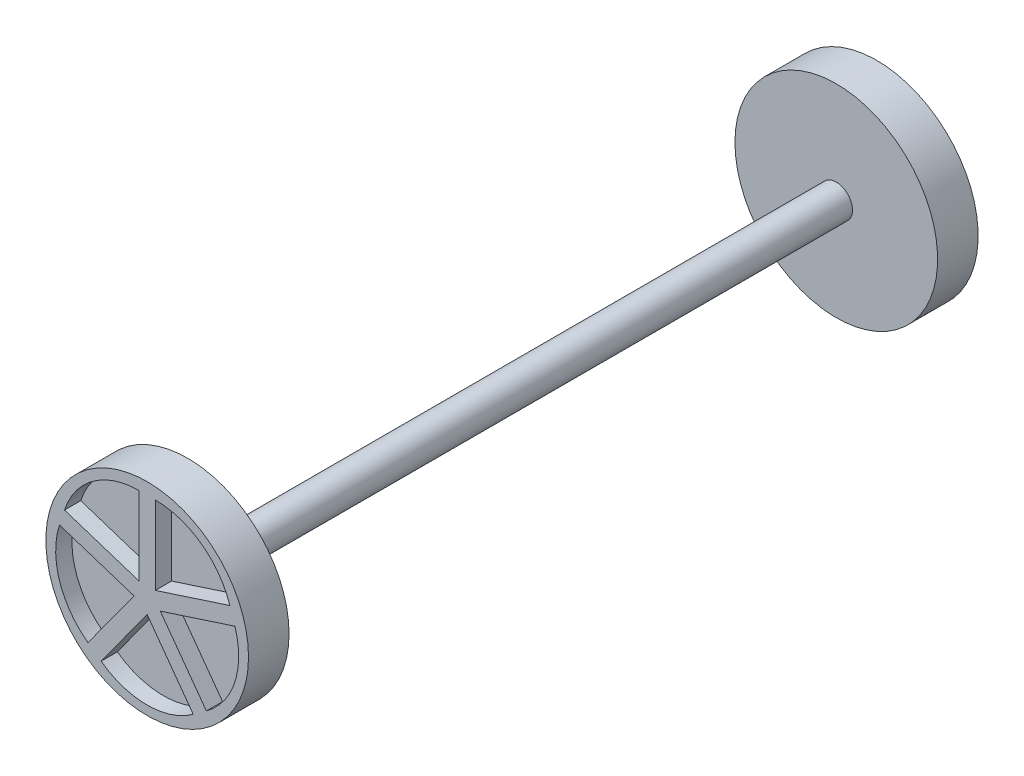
ISO-10303-21;
HEADER;
FILE_DESCRIPTION(('STEP AP214'),'2;1');
FILE_NAME('part.step','',(''),(''),'','','');
FILE_SCHEMA(('AUTOMOTIVE_DESIGN { 1 0 10303 214 1 1 1 1 }'));
ENDSEC;
DATA;
#1=APPLICATION_CONTEXT('core data for automotive mechanical design processes');
#2=APPLICATION_PROTOCOL_DEFINITION('international standard','automotive_design',2000,#1);
#3=PRODUCT_CONTEXT('',#1,'mechanical');
#4=PRODUCT('Part','Part','',(#3));
#5=PRODUCT_RELATED_PRODUCT_CATEGORY('part','',(#4));
#6=PRODUCT_DEFINITION_FORMATION('','',#4);
#7=PRODUCT_DEFINITION_CONTEXT('part definition',#1,'design');
#8=PRODUCT_DEFINITION('design','',#6,#7);
#9=PRODUCT_DEFINITION_SHAPE('','',#8);
#10=(LENGTH_UNIT() NAMED_UNIT(*) SI_UNIT(.MILLI.,.METRE.));
#11=(NAMED_UNIT(*) PLANE_ANGLE_UNIT() SI_UNIT($,.RADIAN.));
#12=(NAMED_UNIT(*) SI_UNIT($,.STERADIAN.) SOLID_ANGLE_UNIT());
#13=UNCERTAINTY_MEASURE_WITH_UNIT(LENGTH_MEASURE(1.E-05),#10,'distance_accuracy_value','');
#14=(GEOMETRIC_REPRESENTATION_CONTEXT(3) GLOBAL_UNCERTAINTY_ASSIGNED_CONTEXT((#13)) GLOBAL_UNIT_ASSIGNED_CONTEXT((#10,
#11,#12)) REPRESENTATION_CONTEXT('',''));
#15=CARTESIAN_POINT('',(0.,0.,0.));
#16=DIRECTION('',(0.,0.,1.));
#17=DIRECTION('',(1.,0.,0.));
#18=AXIS2_PLACEMENT_3D('',#15,#16,#17);
#19=CARTESIAN_POINT('',(0.,0.,-45.));
#20=DIRECTION('',(0.,0.,-1.));
#21=DIRECTION('',(-1.,0.,0.));
#22=AXIS2_PLACEMENT_3D('',#19,#20,#21);
#23=PLANE('',#22);
#24=CARTESIAN_POINT('',(-1.6180339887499,-0.525731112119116,-45.));
#25=DIRECTION('',(0.,0.,1.));
#26=DIRECTION('',(0.809016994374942,-0.58778525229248,0.));
#27=AXIS2_PLACEMENT_3D('',#24,#25,#26);
#28=CIRCLE('',#27,9.67108615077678);
#29=CARTESIAN_POINT('',(-10.8157834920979,2.46279886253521,-45.));
#30=VERTEX_POINT('',#29);
#31=CARTESIAN_POINT('',(-7.30255580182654,-8.34980416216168,-45.));
#32=VERTEX_POINT('',#31);
#33=EDGE_CURVE('E275',#30,#32,#28,.T.);
#34=ORIENTED_EDGE('',*,*,#33,.T.);
#35=DIRECTION('',(0.58778525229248,0.809016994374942,0.));
#36=VECTOR('',#35,1.);
#37=CARTESIAN_POINT('',(-1.6180339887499,-0.525731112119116,-45.));
#38=LINE('',#37,#36);
#39=CARTESIAN_POINT('',(-1.6180339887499,-0.525731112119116,-45.));
#40=VERTEX_POINT('',#39);
#41=EDGE_CURVE('E59',#32,#40,#38,.T.);
#42=ORIENTED_EDGE('',*,*,#41,.T.);
#43=DIRECTION('',(-0.95105651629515,0.309016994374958,0.));
#44=VECTOR('',#43,1.);
#45=CARTESIAN_POINT('',(-1.6180339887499,-0.525731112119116,-45.));
#46=LINE('',#45,#44);
#47=EDGE_CURVE('E269',#40,#30,#46,.T.);
#48=ORIENTED_EDGE('',*,*,#47,.T.);
#49=EDGE_LOOP('',(#34,#42,#48));
#50=FACE_BOUND('',#49,.T.);
#51=CARTESIAN_POINT('',(1.61803398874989,-0.525731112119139,-45.));
#52=DIRECTION('',(0.,0.,1.));
#53=DIRECTION('',(-0.309016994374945,0.951056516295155,0.));
#54=AXIS2_PLACEMENT_3D('',#51,#52,#53);
#55=CIRCLE('',#54,9.67108615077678);
#56=CARTESIAN_POINT('',(7.30255580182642,-8.34980416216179,-45.));
#57=VERTEX_POINT('',#56);
#58=CARTESIAN_POINT('',(10.815783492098,2.46279886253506,-45.));
#59=VERTEX_POINT('',#58);
#60=EDGE_CURVE('E321',#57,#59,#55,.T.);
#61=ORIENTED_EDGE('',*,*,#60,.T.);
#62=DIRECTION('',(-0.951056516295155,-0.309016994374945,0.));
#63=VECTOR('',#62,1.);
#64=CARTESIAN_POINT('',(1.61803398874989,-0.525731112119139,-45.));
#65=LINE('',#64,#63);
#66=CARTESIAN_POINT('',(1.61803398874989,-0.525731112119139,-45.));
#67=VERTEX_POINT('',#66);
#68=EDGE_CURVE('E305',#59,#67,#65,.T.);
#69=ORIENTED_EDGE('',*,*,#68,.T.);
#70=DIRECTION('',(0.587785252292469,-0.809016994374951,0.));
#71=VECTOR('',#70,1.);
#72=CARTESIAN_POINT('',(1.61803398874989,-0.525731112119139,-45.));
#73=LINE('',#72,#71);
#74=EDGE_CURVE('E314',#67,#57,#73,.T.);
#75=ORIENTED_EDGE('',*,*,#74,.T.);
#76=EDGE_LOOP('',(#61,#69,#75));
#77=FACE_BOUND('',#76,.T.);
#78=CARTESIAN_POINT('',(0.,0.,-45.));
#79=DIRECTION('',(0.,0.,-1.));
#80=DIRECTION('',(-1.,0.,0.));
#81=AXIS2_PLACEMENT_3D('',#78,#79,#80);
#82=CIRCLE('',#81,12.5);
#83=CARTESIAN_POINT('',(-12.5,0.,-45.));
#84=VERTEX_POINT('',#83);
#85=EDGE_CURVE('E478',#84,#84,#82,.T.);
#86=ORIENTED_EDGE('',*,*,#85,.T.);
#87=EDGE_LOOP('',(#86));
#88=FACE_BOUND('',#87,.T.);
#89=CARTESIAN_POINT('',(1.,1.37638192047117,-45.));
#90=DIRECTION('',(0.,0.,1.));
#91=DIRECTION('',(-1.,0.,0.));
#92=AXIS2_PLACEMENT_3D('',#89,#90,#91);
#93=CIRCLE('',#92,9.67108615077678);
#94=CARTESIAN_POINT('',(10.1977495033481,4.36491189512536,-45.));
#95=VERTEX_POINT('',#94);
#96=CARTESIAN_POINT('',(0.999999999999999,11.047468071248,-45.));
#97=VERTEX_POINT('',#96);
#98=EDGE_CURVE('E345',#95,#97,#93,.T.);
#99=ORIENTED_EDGE('',*,*,#98,.T.);
#100=DIRECTION('',(0.,-1.,0.));
#101=VECTOR('',#100,1.);
#102=CARTESIAN_POINT('',(1.,1.37638192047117,-45.));
#103=LINE('',#102,#101);
#104=CARTESIAN_POINT('',(1.,1.37638192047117,-45.));
#105=VERTEX_POINT('',#104);
#106=EDGE_CURVE('E329',#97,#105,#103,.T.);
#107=ORIENTED_EDGE('',*,*,#106,.T.);
#108=DIRECTION('',(0.951056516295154,0.309016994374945,0.));
#109=VECTOR('',#108,1.);
#110=CARTESIAN_POINT('',(1.,1.37638192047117,-45.));
#111=LINE('',#110,#109);
#112=EDGE_CURVE('E338',#105,#95,#111,.T.);
#113=ORIENTED_EDGE('',*,*,#112,.T.);
#114=EDGE_LOOP('',(#99,#107,#113));
#115=FACE_BOUND('',#114,.T.);
#116=CARTESIAN_POINT('',(0.,-1.70130161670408,-45.));
#117=DIRECTION('',(0.,0.,1.));
#118=DIRECTION('',(0.809016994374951,0.587785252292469,0.));
#119=AXIS2_PLACEMENT_3D('',#116,#117,#118);
#120=CIRCLE('',#119,9.67108615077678);
#121=CARTESIAN_POINT('',(-5.68452181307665,-9.52537466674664,-45.));
#122=VERTEX_POINT('',#121);
#123=CARTESIAN_POINT('',(5.68452181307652,-9.52537466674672,-45.));
#124=VERTEX_POINT('',#123);
#125=EDGE_CURVE('E297',#122,#124,#120,.T.);
#126=ORIENTED_EDGE('',*,*,#125,.T.);
#127=DIRECTION('',(-0.587785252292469,0.809016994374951,0.));
#128=VECTOR('',#127,1.);
#129=CARTESIAN_POINT('',(0.,-1.70130161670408,-45.));
#130=LINE('',#129,#128);
#131=CARTESIAN_POINT('',(0.,-1.70130161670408,-45.));
#132=VERTEX_POINT('',#131);
#133=EDGE_CURVE('E282',#124,#132,#130,.T.);
#134=ORIENTED_EDGE('',*,*,#133,.T.);
#135=DIRECTION('',(-0.58778525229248,-0.809016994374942,0.));
#136=VECTOR('',#135,1.);
#137=CARTESIAN_POINT('',(0.,-1.70130161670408,-45.));
#138=LINE('',#137,#136);
#139=EDGE_CURVE('E290',#132,#122,#138,.T.);
#140=ORIENTED_EDGE('',*,*,#139,.T.);
#141=EDGE_LOOP('',(#126,#134,#140));
#142=FACE_BOUND('',#141,.T.);
#143=CARTESIAN_POINT('',(-0.999999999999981,1.37638192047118,-45.));
#144=DIRECTION('',(0.,0.,1.));
#145=DIRECTION('',(-0.309016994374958,-0.95105651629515,0.));
#146=AXIS2_PLACEMENT_3D('',#143,#144,#145);
#147=CIRCLE('',#146,9.67108615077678);
#148=CARTESIAN_POINT('',(-0.999999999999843,11.047468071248,-45.));
#149=VERTEX_POINT('',#148);
#150=CARTESIAN_POINT('',(-10.197749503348,4.36491189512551,-45.));
#151=VERTEX_POINT('',#150);
#152=EDGE_CURVE('E256',#149,#151,#147,.T.);
#153=ORIENTED_EDGE('',*,*,#152,.T.);
#154=DIRECTION('',(0.95105651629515,-0.309016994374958,0.));
#155=VECTOR('',#154,1.);
#156=CARTESIAN_POINT('',(-0.999999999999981,1.37638192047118,-45.));
#157=LINE('',#156,#155);
#158=CARTESIAN_POINT('',(-0.999999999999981,1.37638192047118,-45.));
#159=VERTEX_POINT('',#158);
#160=EDGE_CURVE('E51',#151,#159,#157,.T.);
#161=ORIENTED_EDGE('',*,*,#160,.T.);
#162=DIRECTION('',(0.,1.,0.));
#163=VECTOR('',#162,1.);
#164=CARTESIAN_POINT('',(-0.999999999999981,1.37638192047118,-45.));
#165=LINE('',#164,#163);
#166=EDGE_CURVE('E253',#159,#149,#165,.T.);
#167=ORIENTED_EDGE('',*,*,#166,.T.);
#168=EDGE_LOOP('',(#153,#161,#167));
#169=FACE_BOUND('',#168,.T.);
#170=ADVANCED_FACE('F36',(#50,#77,#88,#115,#142,#169),#23,.T.);
#171=CARTESIAN_POINT('',(0.,0.,40.));
#172=DIRECTION('',(0.,0.,-1.));
#173=DIRECTION('',(-1.,0.,0.));
#174=AXIS2_PLACEMENT_3D('',#171,#172,#173);
#175=CYLINDRICAL_SURFACE('',#174,2.);
#176=CARTESIAN_POINT('',(0.,0.,40.));
#177=DIRECTION('',(0.,0.,1.));
#178=DIRECTION('',(1.,0.,0.));
#179=AXIS2_PLACEMENT_3D('',#176,#177,#178);
#180=CIRCLE('',#179,2.);
#181=CARTESIAN_POINT('',(2.,0.,40.));
#182=VERTEX_POINT('',#181);
#183=EDGE_CURVE('E11',#182,#182,#180,.T.);
#184=ORIENTED_EDGE('',*,*,#183,.F.);
#185=EDGE_LOOP('',(#184));
#186=FACE_BOUND('',#185,.T.);
#187=CARTESIAN_POINT('',(0.,0.,-40.));
#188=DIRECTION('',(0.,0.,-1.));
#189=DIRECTION('',(-1.,0.,0.));
#190=AXIS2_PLACEMENT_3D('',#187,#188,#189);
#191=CIRCLE('',#190,2.);
#192=CARTESIAN_POINT('',(-2.,0.,-40.));
#193=VERTEX_POINT('',#192);
#194=EDGE_CURVE('E481',#193,#193,#191,.T.);
#195=ORIENTED_EDGE('',*,*,#194,.F.);
#196=EDGE_LOOP('',(#195));
#197=FACE_BOUND('',#196,.T.);
#198=ADVANCED_FACE('F38',(#186,#197),#175,.T.);
#199=CARTESIAN_POINT('',(0.,0.,40.));
#200=DIRECTION('',(0.,0.,1.));
#201=DIRECTION('',(1.,0.,0.));
#202=AXIS2_PLACEMENT_3D('',#199,#200,#201);
#203=PLANE('',#202);
#204=CARTESIAN_POINT('',(0.,0.,40.));
#205=DIRECTION('',(0.,0.,1.));
#206=DIRECTION('',(1.,0.,0.));
#207=AXIS2_PLACEMENT_3D('',#204,#205,#206);
#208=CIRCLE('',#207,12.5);
#209=CARTESIAN_POINT('',(12.5,0.,40.));
#210=VERTEX_POINT('',#209);
#211=EDGE_CURVE('E486',#210,#210,#208,.T.);
#212=ORIENTED_EDGE('',*,*,#211,.F.);
#213=EDGE_LOOP('',(#212));
#214=FACE_BOUND('',#213,.T.);
#215=ORIENTED_EDGE('',*,*,#183,.T.);
#216=EDGE_LOOP('',(#215));
#217=FACE_BOUND('',#216,.T.);
#218=ADVANCED_FACE('F493',(#214,#217),#203,.F.);
#219=CARTESIAN_POINT('',(0.,0.,45.));
#220=DIRECTION('',(0.,0.,-1.));
#221=DIRECTION('',(-1.,0.,0.));
#222=AXIS2_PLACEMENT_3D('',#219,#220,#221);
#223=CYLINDRICAL_SURFACE('',#222,12.5);
#224=CARTESIAN_POINT('',(0.,0.,45.));
#225=DIRECTION('',(0.,0.,1.));
#226=DIRECTION('',(1.,0.,0.));
#227=AXIS2_PLACEMENT_3D('',#224,#225,#226);
#228=CIRCLE('',#227,12.5);
#229=CARTESIAN_POINT('',(12.5,0.,45.));
#230=VERTEX_POINT('',#229);
#231=EDGE_CURVE('E44',#230,#230,#228,.T.);
#232=ORIENTED_EDGE('',*,*,#231,.F.);
#233=EDGE_LOOP('',(#232));
#234=FACE_BOUND('',#233,.T.);
#235=ORIENTED_EDGE('',*,*,#211,.T.);
#236=EDGE_LOOP('',(#235));
#237=FACE_BOUND('',#236,.T.);
#238=ADVANCED_FACE('F491',(#234,#237),#223,.T.);
#239=CARTESIAN_POINT('',(0.,0.,45.));
#240=DIRECTION('',(0.,0.,1.));
#241=DIRECTION('',(1.,0.,0.));
#242=AXIS2_PLACEMENT_3D('',#239,#240,#241);
#243=PLANE('',#242);
#244=DIRECTION('',(0.95105651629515,-0.309016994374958,0.));
#245=VECTOR('',#244,1.);
#246=CARTESIAN_POINT('',(-0.999999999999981,1.37638192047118,45.));
#247=LINE('',#246,#245);
#248=CARTESIAN_POINT('',(-10.197749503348,4.36491189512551,45.));
#249=VERTEX_POINT('',#248);
#250=CARTESIAN_POINT('',(-0.999999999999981,1.37638192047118,45.));
#251=VERTEX_POINT('',#250);
#252=EDGE_CURVE('E353',#249,#251,#247,.T.);
#253=ORIENTED_EDGE('',*,*,#252,.F.);
#254=CARTESIAN_POINT('',(-0.999999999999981,1.37638192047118,45.));
#255=DIRECTION('',(0.,0.,1.));
#256=DIRECTION('',(-0.309016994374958,-0.95105651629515,0.));
#257=AXIS2_PLACEMENT_3D('',#254,#255,#256);
#258=CIRCLE('',#257,9.67108615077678);
#259=CARTESIAN_POINT('',(-0.999999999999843,11.047468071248,45.));
#260=VERTEX_POINT('',#259);
#261=EDGE_CURVE('E362',#260,#249,#258,.T.);
#262=ORIENTED_EDGE('',*,*,#261,.F.);
#263=DIRECTION('',(0.,1.,0.));
#264=VECTOR('',#263,1.);
#265=CARTESIAN_POINT('',(-0.999999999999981,1.37638192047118,45.));
#266=LINE('',#265,#264);
#267=EDGE_CURVE('E370',#251,#260,#266,.T.);
#268=ORIENTED_EDGE('',*,*,#267,.F.);
#269=EDGE_LOOP('',(#253,#262,#268));
#270=FACE_BOUND('',#269,.T.);
#271=DIRECTION('',(0.58778525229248,0.809016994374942,0.));
#272=VECTOR('',#271,1.);
#273=CARTESIAN_POINT('',(-1.6180339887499,-0.525731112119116,45.));
#274=LINE('',#273,#272);
#275=CARTESIAN_POINT('',(-7.30255580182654,-8.34980416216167,45.));
#276=VERTEX_POINT('',#275);
#277=CARTESIAN_POINT('',(-1.6180339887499,-0.525731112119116,45.));
#278=VERTEX_POINT('',#277);
#279=EDGE_CURVE('E377',#276,#278,#274,.T.);
#280=ORIENTED_EDGE('',*,*,#279,.F.);
#281=CARTESIAN_POINT('',(-1.6180339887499,-0.525731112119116,45.));
#282=DIRECTION('',(0.,0.,1.));
#283=DIRECTION('',(0.809016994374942,-0.58778525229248,0.));
#284=AXIS2_PLACEMENT_3D('',#281,#282,#283);
#285=CIRCLE('',#284,9.67108615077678);
#286=CARTESIAN_POINT('',(-10.8157834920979,2.46279886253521,45.));
#287=VERTEX_POINT('',#286);
#288=EDGE_CURVE('E386',#287,#276,#285,.T.);
#289=ORIENTED_EDGE('',*,*,#288,.F.);
#290=DIRECTION('',(-0.95105651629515,0.309016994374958,0.));
#291=VECTOR('',#290,1.);
#292=CARTESIAN_POINT('',(-1.6180339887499,-0.525731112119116,45.));
#293=LINE('',#292,#291);
#294=EDGE_CURVE('E394',#278,#287,#293,.T.);
#295=ORIENTED_EDGE('',*,*,#294,.F.);
#296=EDGE_LOOP('',(#280,#289,#295));
#297=FACE_BOUND('',#296,.T.);
#298=DIRECTION('',(-0.587785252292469,0.809016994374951,0.));
#299=VECTOR('',#298,1.);
#300=CARTESIAN_POINT('',(0.,-1.70130161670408,45.));
#301=LINE('',#300,#299);
#302=CARTESIAN_POINT('',(5.68452181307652,-9.52537466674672,45.));
#303=VERTEX_POINT('',#302);
#304=CARTESIAN_POINT('',(0.,-1.70130161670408,45.));
#305=VERTEX_POINT('',#304);
#306=EDGE_CURVE('E401',#303,#305,#301,.T.);
#307=ORIENTED_EDGE('',*,*,#306,.F.);
#308=CARTESIAN_POINT('',(0.,-1.70130161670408,45.));
#309=DIRECTION('',(0.,0.,1.));
#310=DIRECTION('',(0.809016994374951,0.587785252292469,0.));
#311=AXIS2_PLACEMENT_3D('',#308,#309,#310);
#312=CIRCLE('',#311,9.67108615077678);
#313=CARTESIAN_POINT('',(-5.68452181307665,-9.52537466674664,45.));
#314=VERTEX_POINT('',#313);
#315=EDGE_CURVE('E410',#314,#303,#312,.T.);
#316=ORIENTED_EDGE('',*,*,#315,.F.);
#317=DIRECTION('',(-0.58778525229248,-0.809016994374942,0.));
#318=VECTOR('',#317,1.);
#319=CARTESIAN_POINT('',(0.,-1.70130161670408,45.));
#320=LINE('',#319,#318);
#321=EDGE_CURVE('E418',#305,#314,#320,.T.);
#322=ORIENTED_EDGE('',*,*,#321,.F.);
#323=EDGE_LOOP('',(#307,#316,#322));
#324=FACE_BOUND('',#323,.T.);
#325=DIRECTION('',(-0.951056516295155,-0.309016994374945,0.));
#326=VECTOR('',#325,1.);
#327=CARTESIAN_POINT('',(1.61803398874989,-0.525731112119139,45.));
#328=LINE('',#327,#326);
#329=CARTESIAN_POINT('',(10.815783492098,2.46279886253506,45.));
#330=VERTEX_POINT('',#329);
#331=CARTESIAN_POINT('',(1.61803398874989,-0.525731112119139,45.));
#332=VERTEX_POINT('',#331);
#333=EDGE_CURVE('E425',#330,#332,#328,.T.);
#334=ORIENTED_EDGE('',*,*,#333,.F.);
#335=CARTESIAN_POINT('',(1.61803398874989,-0.525731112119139,45.));
#336=DIRECTION('',(0.,0.,1.));
#337=DIRECTION('',(-0.309016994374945,0.951056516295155,0.));
#338=AXIS2_PLACEMENT_3D('',#335,#336,#337);
#339=CIRCLE('',#338,9.67108615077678);
#340=CARTESIAN_POINT('',(7.30255580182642,-8.34980416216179,45.));
#341=VERTEX_POINT('',#340);
#342=EDGE_CURVE('E434',#341,#330,#339,.T.);
#343=ORIENTED_EDGE('',*,*,#342,.F.);
#344=DIRECTION('',(0.587785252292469,-0.809016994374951,0.));
#345=VECTOR('',#344,1.);
#346=CARTESIAN_POINT('',(1.61803398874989,-0.525731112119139,45.));
#347=LINE('',#346,#345);
#348=EDGE_CURVE('E442',#332,#341,#347,.T.);
#349=ORIENTED_EDGE('',*,*,#348,.F.);
#350=EDGE_LOOP('',(#334,#343,#349));
#351=FACE_BOUND('',#350,.T.);
#352=DIRECTION('',(0.,-1.,0.));
#353=VECTOR('',#352,1.);
#354=CARTESIAN_POINT('',(1.,1.37638192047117,45.));
#355=LINE('',#354,#353);
#356=CARTESIAN_POINT('',(0.999999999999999,11.047468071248,45.));
#357=VERTEX_POINT('',#356);
#358=CARTESIAN_POINT('',(1.,1.37638192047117,45.));
#359=VERTEX_POINT('',#358);
#360=EDGE_CURVE('E449',#357,#359,#355,.T.);
#361=ORIENTED_EDGE('',*,*,#360,.F.);
#362=CARTESIAN_POINT('',(1.,1.37638192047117,45.));
#363=DIRECTION('',(0.,0.,1.));
#364=DIRECTION('',(-1.,0.,0.));
#365=AXIS2_PLACEMENT_3D('',#362,#363,#364);
#366=CIRCLE('',#365,9.67108615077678);
#367=CARTESIAN_POINT('',(10.1977495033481,4.36491189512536,45.));
#368=VERTEX_POINT('',#367);
#369=EDGE_CURVE('E458',#368,#357,#366,.T.);
#370=ORIENTED_EDGE('',*,*,#369,.F.);
#371=DIRECTION('',(0.951056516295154,0.309016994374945,0.));
#372=VECTOR('',#371,1.);
#373=CARTESIAN_POINT('',(1.,1.37638192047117,45.));
#374=LINE('',#373,#372);
#375=EDGE_CURVE('E466',#359,#368,#374,.T.);
#376=ORIENTED_EDGE('',*,*,#375,.F.);
#377=EDGE_LOOP('',(#361,#370,#376));
#378=FACE_BOUND('',#377,.T.);
#379=ORIENTED_EDGE('',*,*,#231,.T.);
#380=EDGE_LOOP('',(#379));
#381=FACE_BOUND('',#380,.T.);
#382=ADVANCED_FACE('F506',(#270,#297,#324,#351,#378,#381),#243,.T.);
#383=CARTESIAN_POINT('',(0.,0.,-40.));
#384=DIRECTION('',(0.,0.,-1.));
#385=DIRECTION('',(-1.,0.,0.));
#386=AXIS2_PLACEMENT_3D('',#383,#384,#385);
#387=PLANE('',#386);
#388=CARTESIAN_POINT('',(0.,0.,-40.));
#389=DIRECTION('',(0.,0.,-1.));
#390=DIRECTION('',(-1.,0.,0.));
#391=AXIS2_PLACEMENT_3D('',#388,#389,#390);
#392=CIRCLE('',#391,12.5);
#393=CARTESIAN_POINT('',(-12.5,0.,-40.));
#394=VERTEX_POINT('',#393);
#395=EDGE_CURVE('E473',#394,#394,#392,.T.);
#396=ORIENTED_EDGE('',*,*,#395,.F.);
#397=EDGE_LOOP('',(#396));
#398=FACE_BOUND('',#397,.T.);
#399=ORIENTED_EDGE('',*,*,#194,.T.);
#400=EDGE_LOOP('',(#399));
#401=FACE_BOUND('',#400,.T.);
#402=ADVANCED_FACE('F503',(#398,#401),#387,.F.);
#403=CARTESIAN_POINT('',(0.,0.,-45.));
#404=DIRECTION('',(0.,0.,1.));
#405=DIRECTION('',(1.,0.,0.));
#406=AXIS2_PLACEMENT_3D('',#403,#404,#405);
#407=CYLINDRICAL_SURFACE('',#406,12.5);
#408=ORIENTED_EDGE('',*,*,#85,.F.);
#409=EDGE_LOOP('',(#408));
#410=FACE_BOUND('',#409,.T.);
#411=ORIENTED_EDGE('',*,*,#395,.T.);
#412=EDGE_LOOP('',(#411));
#413=FACE_BOUND('',#412,.T.);
#414=ADVANCED_FACE('F505',(#410,#413),#407,.T.);
#415=CARTESIAN_POINT('',(1.,1.37638192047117,43.));
#416=DIRECTION('',(-1.,0.,0.));
#417=DIRECTION('',(0.,0.,1.));
#418=AXIS2_PLACEMENT_3D('',#415,#416,#417);
#419=PLANE('',#418);
#420=ORIENTED_EDGE('',*,*,#360,.T.);
#421=DIRECTION('',(0.,0.,1.));
#422=VECTOR('',#421,1.);
#423=CARTESIAN_POINT('',(1.,1.37638192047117,43.));
#424=LINE('',#423,#422);
#425=CARTESIAN_POINT('',(1.,1.37638192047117,43.));
#426=VERTEX_POINT('',#425);
#427=EDGE_CURVE('E464',#426,#359,#424,.T.);
#428=ORIENTED_EDGE('',*,*,#427,.F.);
#429=DIRECTION('',(0.,-1.,0.));
#430=VECTOR('',#429,1.);
#431=CARTESIAN_POINT('',(1.,1.37638192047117,43.));
#432=LINE('',#431,#430);
#433=CARTESIAN_POINT('',(0.999999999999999,11.047468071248,43.));
#434=VERTEX_POINT('',#433);
#435=EDGE_CURVE('E454',#434,#426,#432,.T.);
#436=ORIENTED_EDGE('',*,*,#435,.F.);
#437=DIRECTION('',(0.,0.,1.));
#438=VECTOR('',#437,1.);
#439=CARTESIAN_POINT('',(0.999999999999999,11.047468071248,43.));
#440=LINE('',#439,#438);
#441=EDGE_CURVE('E471',#434,#357,#440,.T.);
#442=ORIENTED_EDGE('',*,*,#441,.T.);
#443=EDGE_LOOP('',(#420,#428,#436,#442));
#444=FACE_BOUND('',#443,.T.);
#445=ADVANCED_FACE('F513',(#444),#419,.F.);
#446=CARTESIAN_POINT('',(1.,1.37638192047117,43.));
#447=DIRECTION('',(0.,0.,1.));
#448=DIRECTION('',(1.,0.,0.));
#449=AXIS2_PLACEMENT_3D('',#446,#447,#448);
#450=CYLINDRICAL_SURFACE('',#449,9.67108615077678);
#451=ORIENTED_EDGE('',*,*,#369,.T.);
#452=ORIENTED_EDGE('',*,*,#441,.F.);
#453=CARTESIAN_POINT('',(1.,1.37638192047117,43.));
#454=DIRECTION('',(0.,0.,1.));
#455=DIRECTION('',(-1.,0.,0.));
#456=AXIS2_PLACEMENT_3D('',#453,#454,#455);
#457=CIRCLE('',#456,9.67108615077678);
#458=CARTESIAN_POINT('',(10.1977495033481,4.36491189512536,43.));
#459=VERTEX_POINT('',#458);
#460=EDGE_CURVE('E461',#459,#434,#457,.T.);
#461=ORIENTED_EDGE('',*,*,#460,.F.);
#462=DIRECTION('',(0.,0.,1.));
#463=VECTOR('',#462,1.);
#464=CARTESIAN_POINT('',(10.1977495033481,4.36491189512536,43.));
#465=LINE('',#464,#463);
#466=EDGE_CURVE('E474',#459,#368,#465,.T.);
#467=ORIENTED_EDGE('',*,*,#466,.T.);
#468=EDGE_LOOP('',(#451,#452,#461,#467));
#469=FACE_BOUND('',#468,.T.);
#470=ADVANCED_FACE('F528',(#469),#450,.F.);
#471=CARTESIAN_POINT('',(1.,1.37638192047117,43.));
#472=DIRECTION('',(0.309016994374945,-0.951056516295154,0.));
#473=DIRECTION('',(0.951056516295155,0.309016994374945,0.));
#474=AXIS2_PLACEMENT_3D('',#471,#472,#473);
#475=PLANE('',#474);
#476=ORIENTED_EDGE('',*,*,#375,.T.);
#477=ORIENTED_EDGE('',*,*,#466,.F.);
#478=DIRECTION('',(0.951056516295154,0.309016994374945,0.));
#479=VECTOR('',#478,1.);
#480=CARTESIAN_POINT('',(1.,1.37638192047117,43.));
#481=LINE('',#480,#479);
#482=EDGE_CURVE('E457',#426,#459,#481,.T.);
#483=ORIENTED_EDGE('',*,*,#482,.F.);
#484=ORIENTED_EDGE('',*,*,#427,.T.);
#485=EDGE_LOOP('',(#476,#477,#483,#484));
#486=FACE_BOUND('',#485,.T.);
#487=ADVANCED_FACE('F530',(#486),#475,.F.);
#488=CARTESIAN_POINT('',(1.,1.37638192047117,43.));
#489=DIRECTION('',(0.,0.,-1.));
#490=DIRECTION('',(-1.,0.,0.));
#491=AXIS2_PLACEMENT_3D('',#488,#489,#490);
#492=PLANE('',#491);
#493=ORIENTED_EDGE('',*,*,#435,.T.);
#494=ORIENTED_EDGE('',*,*,#482,.T.);
#495=ORIENTED_EDGE('',*,*,#460,.T.);
#496=EDGE_LOOP('',(#493,#494,#495));
#497=FACE_BOUND('',#496,.T.);
#498=ADVANCED_FACE('F533',(#497),#492,.F.);
#499=CARTESIAN_POINT('',(1.61803398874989,-0.525731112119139,43.));
#500=DIRECTION('',(-0.309016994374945,0.951056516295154,0.));
#501=DIRECTION('',(-0.951056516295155,-0.309016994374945,0.));
#502=AXIS2_PLACEMENT_3D('',#499,#500,#501);
#503=PLANE('',#502);
#504=ORIENTED_EDGE('',*,*,#333,.T.);
#505=DIRECTION('',(0.,0.,1.));
#506=VECTOR('',#505,1.);
#507=CARTESIAN_POINT('',(1.61803398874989,-0.525731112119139,43.));
#508=LINE('',#507,#506);
#509=CARTESIAN_POINT('',(1.61803398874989,-0.525731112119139,43.));
#510=VERTEX_POINT('',#509);
#511=EDGE_CURVE('E440',#510,#332,#508,.T.);
#512=ORIENTED_EDGE('',*,*,#511,.F.);
#513=DIRECTION('',(-0.951056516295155,-0.309016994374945,0.));
#514=VECTOR('',#513,1.);
#515=CARTESIAN_POINT('',(1.61803398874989,-0.525731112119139,43.));
#516=LINE('',#515,#514);
#517=CARTESIAN_POINT('',(10.815783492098,2.46279886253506,43.));
#518=VERTEX_POINT('',#517);
#519=EDGE_CURVE('E430',#518,#510,#516,.T.);
#520=ORIENTED_EDGE('',*,*,#519,.F.);
#521=DIRECTION('',(0.,0.,1.));
#522=VECTOR('',#521,1.);
#523=CARTESIAN_POINT('',(10.815783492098,2.46279886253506,43.));
#524=LINE('',#523,#522);
#525=EDGE_CURVE('E447',#518,#330,#524,.T.);
#526=ORIENTED_EDGE('',*,*,#525,.T.);
#527=EDGE_LOOP('',(#504,#512,#520,#526));
#528=FACE_BOUND('',#527,.T.);
#529=ADVANCED_FACE('F540',(#528),#503,.F.);
#530=CARTESIAN_POINT('',(1.61803398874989,-0.525731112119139,43.));
#531=DIRECTION('',(0.,0.,1.));
#532=DIRECTION('',(1.,0.,0.));
#533=AXIS2_PLACEMENT_3D('',#530,#531,#532);
#534=CYLINDRICAL_SURFACE('',#533,9.67108615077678);
#535=ORIENTED_EDGE('',*,*,#342,.T.);
#536=ORIENTED_EDGE('',*,*,#525,.F.);
#537=CARTESIAN_POINT('',(1.61803398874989,-0.525731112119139,43.));
#538=DIRECTION('',(0.,0.,1.));
#539=DIRECTION('',(-0.309016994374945,0.951056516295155,0.));
#540=AXIS2_PLACEMENT_3D('',#537,#538,#539);
#541=CIRCLE('',#540,9.67108615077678);
#542=CARTESIAN_POINT('',(7.30255580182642,-8.34980416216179,43.));
#543=VERTEX_POINT('',#542);
#544=EDGE_CURVE('E437',#543,#518,#541,.T.);
#545=ORIENTED_EDGE('',*,*,#544,.F.);
#546=DIRECTION('',(0.,0.,1.));
#547=VECTOR('',#546,1.);
#548=CARTESIAN_POINT('',(7.30255580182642,-8.34980416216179,43.));
#549=LINE('',#548,#547);
#550=EDGE_CURVE('E450',#543,#341,#549,.T.);
#551=ORIENTED_EDGE('',*,*,#550,.T.);
#552=EDGE_LOOP('',(#535,#536,#545,#551));
#553=FACE_BOUND('',#552,.T.);
#554=ADVANCED_FACE('F544',(#553),#534,.F.);
#555=CARTESIAN_POINT('',(1.61803398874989,-0.525731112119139,43.));
#556=DIRECTION('',(-0.809016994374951,-0.587785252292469,0.));
#557=DIRECTION('',(0.587785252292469,-0.809016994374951,0.));
#558=AXIS2_PLACEMENT_3D('',#555,#556,#557);
#559=PLANE('',#558);
#560=ORIENTED_EDGE('',*,*,#348,.T.);
#561=ORIENTED_EDGE('',*,*,#550,.F.);
#562=DIRECTION('',(0.587785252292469,-0.809016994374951,0.));
#563=VECTOR('',#562,1.);
#564=CARTESIAN_POINT('',(1.61803398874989,-0.525731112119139,43.));
#565=LINE('',#564,#563);
#566=EDGE_CURVE('E433',#510,#543,#565,.T.);
#567=ORIENTED_EDGE('',*,*,#566,.F.);
#568=ORIENTED_EDGE('',*,*,#511,.T.);
#569=EDGE_LOOP('',(#560,#561,#567,#568));
#570=FACE_BOUND('',#569,.T.);
#571=ADVANCED_FACE('F546',(#570),#559,.F.);
#572=CARTESIAN_POINT('',(1.61803398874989,-0.525731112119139,43.));
#573=DIRECTION('',(0.,0.,-1.));
#574=DIRECTION('',(-0.309016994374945,0.951056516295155,0.));
#575=AXIS2_PLACEMENT_3D('',#572,#573,#574);
#576=PLANE('',#575);
#577=ORIENTED_EDGE('',*,*,#519,.T.);
#578=ORIENTED_EDGE('',*,*,#566,.T.);
#579=ORIENTED_EDGE('',*,*,#544,.T.);
#580=EDGE_LOOP('',(#577,#578,#579));
#581=FACE_BOUND('',#580,.T.);
#582=ADVANCED_FACE('F549',(#581),#576,.F.);
#583=CARTESIAN_POINT('',(0.,-1.70130161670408,43.));
#584=DIRECTION('',(0.809016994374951,0.587785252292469,0.));
#585=DIRECTION('',(-0.587785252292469,0.809016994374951,0.));
#586=AXIS2_PLACEMENT_3D('',#583,#584,#585);
#587=PLANE('',#586);
#588=ORIENTED_EDGE('',*,*,#306,.T.);
#589=DIRECTION('',(0.,0.,1.));
#590=VECTOR('',#589,1.);
#591=CARTESIAN_POINT('',(0.,-1.70130161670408,43.));
#592=LINE('',#591,#590);
#593=CARTESIAN_POINT('',(0.,-1.70130161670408,43.));
#594=VERTEX_POINT('',#593);
#595=EDGE_CURVE('E416',#594,#305,#592,.T.);
#596=ORIENTED_EDGE('',*,*,#595,.F.);
#597=DIRECTION('',(-0.587785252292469,0.809016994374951,0.));
#598=VECTOR('',#597,1.);
#599=CARTESIAN_POINT('',(0.,-1.70130161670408,43.));
#600=LINE('',#599,#598);
#601=CARTESIAN_POINT('',(5.68452181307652,-9.52537466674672,43.));
#602=VERTEX_POINT('',#601);
#603=EDGE_CURVE('E406',#602,#594,#600,.T.);
#604=ORIENTED_EDGE('',*,*,#603,.F.);
#605=DIRECTION('',(0.,0.,1.));
#606=VECTOR('',#605,1.);
#607=CARTESIAN_POINT('',(5.68452181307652,-9.52537466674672,43.));
#608=LINE('',#607,#606);
#609=EDGE_CURVE('E423',#602,#303,#608,.T.);
#610=ORIENTED_EDGE('',*,*,#609,.T.);
#611=EDGE_LOOP('',(#588,#596,#604,#610));
#612=FACE_BOUND('',#611,.T.);
#613=ADVANCED_FACE('F556',(#612),#587,.F.);
#614=CARTESIAN_POINT('',(0.,-1.70130161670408,43.));
#615=DIRECTION('',(0.,0.,1.));
#616=DIRECTION('',(1.,0.,0.));
#617=AXIS2_PLACEMENT_3D('',#614,#615,#616);
#618=CYLINDRICAL_SURFACE('',#617,9.67108615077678);
#619=ORIENTED_EDGE('',*,*,#315,.T.);
#620=ORIENTED_EDGE('',*,*,#609,.F.);
#621=CARTESIAN_POINT('',(0.,-1.70130161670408,43.));
#622=DIRECTION('',(0.,0.,1.));
#623=DIRECTION('',(0.809016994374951,0.587785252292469,0.));
#624=AXIS2_PLACEMENT_3D('',#621,#622,#623);
#625=CIRCLE('',#624,9.67108615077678);
#626=CARTESIAN_POINT('',(-5.68452181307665,-9.52537466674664,43.));
#627=VERTEX_POINT('',#626);
#628=EDGE_CURVE('E413',#627,#602,#625,.T.);
#629=ORIENTED_EDGE('',*,*,#628,.F.);
#630=DIRECTION('',(0.,0.,1.));
#631=VECTOR('',#630,1.);
#632=CARTESIAN_POINT('',(-5.68452181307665,-9.52537466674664,43.));
#633=LINE('',#632,#631);
#634=EDGE_CURVE('E426',#627,#314,#633,.T.);
#635=ORIENTED_EDGE('',*,*,#634,.T.);
#636=EDGE_LOOP('',(#619,#620,#629,#635));
#637=FACE_BOUND('',#636,.T.);
#638=ADVANCED_FACE('F560',(#637),#618,.F.);
#639=CARTESIAN_POINT('',(0.,-1.70130161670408,43.));
#640=DIRECTION('',(-0.809016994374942,0.58778525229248,0.));
#641=DIRECTION('',(-0.58778525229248,-0.809016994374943,0.));
#642=AXIS2_PLACEMENT_3D('',#639,#640,#641);
#643=PLANE('',#642);
#644=ORIENTED_EDGE('',*,*,#321,.T.);
#645=ORIENTED_EDGE('',*,*,#634,.F.);
#646=DIRECTION('',(-0.58778525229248,-0.809016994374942,0.));
#647=VECTOR('',#646,1.);
#648=CARTESIAN_POINT('',(0.,-1.70130161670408,43.));
#649=LINE('',#648,#647);
#650=EDGE_CURVE('E409',#594,#627,#649,.T.);
#651=ORIENTED_EDGE('',*,*,#650,.F.);
#652=ORIENTED_EDGE('',*,*,#595,.T.);
#653=EDGE_LOOP('',(#644,#645,#651,#652));
#654=FACE_BOUND('',#653,.T.);
#655=ADVANCED_FACE('F562',(#654),#643,.F.);
#656=CARTESIAN_POINT('',(0.,-1.70130161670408,43.));
#657=DIRECTION('',(0.,0.,-1.));
#658=DIRECTION('',(0.809016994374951,0.587785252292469,0.));
#659=AXIS2_PLACEMENT_3D('',#656,#657,#658);
#660=PLANE('',#659);
#661=ORIENTED_EDGE('',*,*,#603,.T.);
#662=ORIENTED_EDGE('',*,*,#650,.T.);
#663=ORIENTED_EDGE('',*,*,#628,.T.);
#664=EDGE_LOOP('',(#661,#662,#663));
#665=FACE_BOUND('',#664,.T.);
#666=ADVANCED_FACE('F565',(#665),#660,.F.);
#667=CARTESIAN_POINT('',(-1.6180339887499,-0.525731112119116,43.));
#668=DIRECTION('',(0.809016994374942,-0.58778525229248,0.));
#669=DIRECTION('',(0.58778525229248,0.809016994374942,0.));
#670=AXIS2_PLACEMENT_3D('',#667,#668,#669);
#671=PLANE('',#670);
#672=ORIENTED_EDGE('',*,*,#279,.T.);
#673=DIRECTION('',(0.,0.,1.));
#674=VECTOR('',#673,1.);
#675=CARTESIAN_POINT('',(-1.6180339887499,-0.525731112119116,43.));
#676=LINE('',#675,#674);
#677=CARTESIAN_POINT('',(-1.6180339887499,-0.525731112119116,43.));
#678=VERTEX_POINT('',#677);
#679=EDGE_CURVE('E392',#678,#278,#676,.T.);
#680=ORIENTED_EDGE('',*,*,#679,.F.);
#681=DIRECTION('',(0.58778525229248,0.809016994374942,0.));
#682=VECTOR('',#681,1.);
#683=CARTESIAN_POINT('',(-1.6180339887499,-0.525731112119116,43.));
#684=LINE('',#683,#682);
#685=CARTESIAN_POINT('',(-7.30255580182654,-8.34980416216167,43.));
#686=VERTEX_POINT('',#685);
#687=EDGE_CURVE('E382',#686,#678,#684,.T.);
#688=ORIENTED_EDGE('',*,*,#687,.F.);
#689=DIRECTION('',(0.,0.,1.));
#690=VECTOR('',#689,1.);
#691=CARTESIAN_POINT('',(-7.30255580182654,-8.34980416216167,43.));
#692=LINE('',#691,#690);
#693=EDGE_CURVE('E399',#686,#276,#692,.T.);
#694=ORIENTED_EDGE('',*,*,#693,.T.);
#695=EDGE_LOOP('',(#672,#680,#688,#694));
#696=FACE_BOUND('',#695,.T.);
#697=ADVANCED_FACE('F572',(#696),#671,.F.);
#698=CARTESIAN_POINT('',(-1.6180339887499,-0.525731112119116,43.));
#699=DIRECTION('',(0.,0.,1.));
#700=DIRECTION('',(1.,0.,0.));
#701=AXIS2_PLACEMENT_3D('',#698,#699,#700);
#702=CYLINDRICAL_SURFACE('',#701,9.67108615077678);
#703=ORIENTED_EDGE('',*,*,#288,.T.);
#704=ORIENTED_EDGE('',*,*,#693,.F.);
#705=CARTESIAN_POINT('',(-1.6180339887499,-0.525731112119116,43.));
#706=DIRECTION('',(0.,0.,1.));
#707=DIRECTION('',(0.809016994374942,-0.58778525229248,0.));
#708=AXIS2_PLACEMENT_3D('',#705,#706,#707);
#709=CIRCLE('',#708,9.67108615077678);
#710=CARTESIAN_POINT('',(-10.8157834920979,2.46279886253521,43.));
#711=VERTEX_POINT('',#710);
#712=EDGE_CURVE('E389',#711,#686,#709,.T.);
#713=ORIENTED_EDGE('',*,*,#712,.F.);
#714=DIRECTION('',(0.,0.,1.));
#715=VECTOR('',#714,1.);
#716=CARTESIAN_POINT('',(-10.8157834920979,2.46279886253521,43.));
#717=LINE('',#716,#715);
#718=EDGE_CURVE('E402',#711,#287,#717,.T.);
#719=ORIENTED_EDGE('',*,*,#718,.T.);
#720=EDGE_LOOP('',(#703,#704,#713,#719));
#721=FACE_BOUND('',#720,.T.);
#722=ADVANCED_FACE('F576',(#721),#702,.F.);
#723=CARTESIAN_POINT('',(-1.6180339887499,-0.525731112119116,43.));
#724=DIRECTION('',(0.309016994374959,0.95105651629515,0.));
#725=DIRECTION('',(-0.95105651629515,0.309016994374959,0.));
#726=AXIS2_PLACEMENT_3D('',#723,#724,#725);
#727=PLANE('',#726);
#728=ORIENTED_EDGE('',*,*,#294,.T.);
#729=ORIENTED_EDGE('',*,*,#718,.F.);
#730=DIRECTION('',(-0.95105651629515,0.309016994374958,0.));
#731=VECTOR('',#730,1.);
#732=CARTESIAN_POINT('',(-1.6180339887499,-0.525731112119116,43.));
#733=LINE('',#732,#731);
#734=EDGE_CURVE('E385',#678,#711,#733,.T.);
#735=ORIENTED_EDGE('',*,*,#734,.F.);
#736=ORIENTED_EDGE('',*,*,#679,.T.);
#737=EDGE_LOOP('',(#728,#729,#735,#736));
#738=FACE_BOUND('',#737,.T.);
#739=ADVANCED_FACE('F578',(#738),#727,.F.);
#740=CARTESIAN_POINT('',(-1.6180339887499,-0.525731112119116,43.));
#741=DIRECTION('',(0.,0.,-1.));
#742=DIRECTION('',(0.809016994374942,-0.58778525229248,0.));
#743=AXIS2_PLACEMENT_3D('',#740,#741,#742);
#744=PLANE('',#743);
#745=ORIENTED_EDGE('',*,*,#687,.T.);
#746=ORIENTED_EDGE('',*,*,#734,.T.);
#747=ORIENTED_EDGE('',*,*,#712,.T.);
#748=EDGE_LOOP('',(#745,#746,#747));
#749=FACE_BOUND('',#748,.T.);
#750=ADVANCED_FACE('F581',(#749),#744,.F.);
#751=CARTESIAN_POINT('',(-0.999999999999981,1.37638192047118,43.));
#752=DIRECTION('',(-0.309016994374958,-0.95105651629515,0.));
#753=DIRECTION('',(0.95105651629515,-0.309016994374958,0.));
#754=AXIS2_PLACEMENT_3D('',#751,#752,#753);
#755=PLANE('',#754);
#756=ORIENTED_EDGE('',*,*,#252,.T.);
#757=DIRECTION('',(0.,0.,1.));
#758=VECTOR('',#757,1.);
#759=CARTESIAN_POINT('',(-0.999999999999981,1.37638192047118,43.));
#760=LINE('',#759,#758);
#761=CARTESIAN_POINT('',(-0.999999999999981,1.37638192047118,43.));
#762=VERTEX_POINT('',#761);
#763=EDGE_CURVE('E368',#762,#251,#760,.T.);
#764=ORIENTED_EDGE('',*,*,#763,.F.);
#765=DIRECTION('',(0.95105651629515,-0.309016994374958,0.));
#766=VECTOR('',#765,1.);
#767=CARTESIAN_POINT('',(-0.999999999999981,1.37638192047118,43.));
#768=LINE('',#767,#766);
#769=CARTESIAN_POINT('',(-10.197749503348,4.36491189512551,43.));
#770=VERTEX_POINT('',#769);
#771=EDGE_CURVE('E358',#770,#762,#768,.T.);
#772=ORIENTED_EDGE('',*,*,#771,.F.);
#773=DIRECTION('',(0.,0.,1.));
#774=VECTOR('',#773,1.);
#775=CARTESIAN_POINT('',(-10.197749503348,4.36491189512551,43.));
#776=LINE('',#775,#774);
#777=EDGE_CURVE('E375',#770,#249,#776,.T.);
#778=ORIENTED_EDGE('',*,*,#777,.T.);
#779=EDGE_LOOP('',(#756,#764,#772,#778));
#780=FACE_BOUND('',#779,.T.);
#781=ADVANCED_FACE('F588',(#780),#755,.F.);
#782=CARTESIAN_POINT('',(-0.999999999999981,1.37638192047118,43.));
#783=DIRECTION('',(0.,0.,1.));
#784=DIRECTION('',(1.,0.,0.));
#785=AXIS2_PLACEMENT_3D('',#782,#783,#784);
#786=CYLINDRICAL_SURFACE('',#785,9.67108615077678);
#787=ORIENTED_EDGE('',*,*,#261,.T.);
#788=ORIENTED_EDGE('',*,*,#777,.F.);
#789=CARTESIAN_POINT('',(-0.999999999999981,1.37638192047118,43.));
#790=DIRECTION('',(0.,0.,1.));
#791=DIRECTION('',(-0.309016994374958,-0.95105651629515,0.));
#792=AXIS2_PLACEMENT_3D('',#789,#790,#791);
#793=CIRCLE('',#792,9.67108615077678);
#794=CARTESIAN_POINT('',(-0.999999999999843,11.047468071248,43.));
#795=VERTEX_POINT('',#794);
#796=EDGE_CURVE('E365',#795,#770,#793,.T.);
#797=ORIENTED_EDGE('',*,*,#796,.F.);
#798=DIRECTION('',(0.,0.,1.));
#799=VECTOR('',#798,1.);
#800=CARTESIAN_POINT('',(-0.999999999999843,11.047468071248,43.));
#801=LINE('',#800,#799);
#802=EDGE_CURVE('E378',#795,#260,#801,.T.);
#803=ORIENTED_EDGE('',*,*,#802,.T.);
#804=EDGE_LOOP('',(#787,#788,#797,#803));
#805=FACE_BOUND('',#804,.T.);
#806=ADVANCED_FACE('F592',(#805),#786,.F.);
#807=CARTESIAN_POINT('',(-0.999999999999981,1.37638192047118,43.));
#808=DIRECTION('',(1.,0.,0.));
#809=DIRECTION('',(0.,1.,0.));
#810=AXIS2_PLACEMENT_3D('',#807,#808,#809);
#811=PLANE('',#810);
#812=ORIENTED_EDGE('',*,*,#267,.T.);
#813=ORIENTED_EDGE('',*,*,#802,.F.);
#814=DIRECTION('',(0.,1.,0.));
#815=VECTOR('',#814,1.);
#816=CARTESIAN_POINT('',(-0.999999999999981,1.37638192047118,43.));
#817=LINE('',#816,#815);
#818=EDGE_CURVE('E361',#762,#795,#817,.T.);
#819=ORIENTED_EDGE('',*,*,#818,.F.);
#820=ORIENTED_EDGE('',*,*,#763,.T.);
#821=EDGE_LOOP('',(#812,#813,#819,#820));
#822=FACE_BOUND('',#821,.T.);
#823=ADVANCED_FACE('F594',(#822),#811,.F.);
#824=CARTESIAN_POINT('',(-0.999999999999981,1.37638192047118,43.));
#825=DIRECTION('',(0.,0.,-1.));
#826=DIRECTION('',(-0.309016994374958,-0.95105651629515,0.));
#827=AXIS2_PLACEMENT_3D('',#824,#825,#826);
#828=PLANE('',#827);
#829=ORIENTED_EDGE('',*,*,#771,.T.);
#830=ORIENTED_EDGE('',*,*,#818,.T.);
#831=ORIENTED_EDGE('',*,*,#796,.T.);
#832=EDGE_LOOP('',(#829,#830,#831));
#833=FACE_BOUND('',#832,.T.);
#834=ADVANCED_FACE('F597',(#833),#828,.F.);
#835=CARTESIAN_POINT('',(1.,1.37638192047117,-43.));
#836=DIRECTION('',(1.,0.,0.));
#837=DIRECTION('',(0.,0.,-1.));
#838=AXIS2_PLACEMENT_3D('',#835,#836,#837);
#839=PLANE('',#838);
#840=ORIENTED_EDGE('',*,*,#106,.F.);
#841=DIRECTION('',(0.,0.,-1.));
#842=VECTOR('',#841,1.);
#843=CARTESIAN_POINT('',(0.999999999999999,11.047468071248,-43.));
#844=LINE('',#843,#842);
#845=CARTESIAN_POINT('',(0.999999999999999,11.047468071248,-43.));
#846=VERTEX_POINT('',#845);
#847=EDGE_CURVE('E342',#846,#97,#844,.T.);
#848=ORIENTED_EDGE('',*,*,#847,.F.);
#849=DIRECTION('',(0.,-1.,0.));
#850=VECTOR('',#849,1.);
#851=CARTESIAN_POINT('',(1.,1.37638192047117,-43.));
#852=LINE('',#851,#850);
#853=CARTESIAN_POINT('',(1.,1.37638192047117,-43.));
#854=VERTEX_POINT('',#853);
#855=EDGE_CURVE('E334',#846,#854,#852,.T.);
#856=ORIENTED_EDGE('',*,*,#855,.T.);
#857=DIRECTION('',(0.,0.,-1.));
#858=VECTOR('',#857,1.);
#859=CARTESIAN_POINT('',(1.,1.37638192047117,-43.));
#860=LINE('',#859,#858);
#861=EDGE_CURVE('E350',#854,#105,#860,.T.);
#862=ORIENTED_EDGE('',*,*,#861,.T.);
#863=EDGE_LOOP('',(#840,#848,#856,#862));
#864=FACE_BOUND('',#863,.T.);
#865=ADVANCED_FACE('F604',(#864),#839,.T.);
#866=CARTESIAN_POINT('',(1.,1.37638192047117,-43.));
#867=DIRECTION('',(-0.309016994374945,0.951056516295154,0.));
#868=DIRECTION('',(-0.951056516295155,-0.309016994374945,0.));
#869=AXIS2_PLACEMENT_3D('',#866,#867,#868);
#870=PLANE('',#869);
#871=ORIENTED_EDGE('',*,*,#112,.F.);
#872=ORIENTED_EDGE('',*,*,#861,.F.);
#873=DIRECTION('',(0.951056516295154,0.309016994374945,0.));
#874=VECTOR('',#873,1.);
#875=CARTESIAN_POINT('',(1.,1.37638192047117,-43.));
#876=LINE('',#875,#874);
#877=CARTESIAN_POINT('',(10.1977495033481,4.36491189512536,-43.));
#878=VERTEX_POINT('',#877);
#879=EDGE_CURVE('E340',#854,#878,#876,.T.);
#880=ORIENTED_EDGE('',*,*,#879,.T.);
#881=DIRECTION('',(0.,0.,-1.));
#882=VECTOR('',#881,1.);
#883=CARTESIAN_POINT('',(10.1977495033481,4.36491189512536,-43.));
#884=LINE('',#883,#882);
#885=EDGE_CURVE('E354',#878,#95,#884,.T.);
#886=ORIENTED_EDGE('',*,*,#885,.T.);
#887=EDGE_LOOP('',(#871,#872,#880,#886));
#888=FACE_BOUND('',#887,.T.);
#889=ADVANCED_FACE('F608',(#888),#870,.T.);
#890=CARTESIAN_POINT('',(1.,1.37638192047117,-43.));
#891=DIRECTION('',(0.,0.,-1.));
#892=DIRECTION('',(-1.,0.,0.));
#893=AXIS2_PLACEMENT_3D('',#890,#891,#892);
#894=CYLINDRICAL_SURFACE('',#893,9.67108615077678);
#895=ORIENTED_EDGE('',*,*,#98,.F.);
#896=ORIENTED_EDGE('',*,*,#885,.F.);
#897=CARTESIAN_POINT('',(1.,1.37638192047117,-43.));
#898=DIRECTION('',(0.,0.,1.));
#899=DIRECTION('',(-1.,0.,0.));
#900=AXIS2_PLACEMENT_3D('',#897,#898,#899);
#901=CIRCLE('',#900,9.67108615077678);
#902=EDGE_CURVE('E337',#878,#846,#901,.T.);
#903=ORIENTED_EDGE('',*,*,#902,.T.);
#904=ORIENTED_EDGE('',*,*,#847,.T.);
#905=EDGE_LOOP('',(#895,#896,#903,#904));
#906=FACE_BOUND('',#905,.T.);
#907=ADVANCED_FACE('F610',(#906),#894,.F.);
#908=CARTESIAN_POINT('',(1.,1.37638192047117,-43.));
#909=DIRECTION('',(0.,0.,1.));
#910=DIRECTION('',(-1.,0.,0.));
#911=AXIS2_PLACEMENT_3D('',#908,#909,#910);
#912=PLANE('',#911);
#913=ORIENTED_EDGE('',*,*,#855,.F.);
#914=ORIENTED_EDGE('',*,*,#902,.F.);
#915=ORIENTED_EDGE('',*,*,#879,.F.);
#916=EDGE_LOOP('',(#913,#914,#915));
#917=FACE_BOUND('',#916,.T.);
#918=ADVANCED_FACE('F613',(#917),#912,.F.);
#919=CARTESIAN_POINT('',(1.61803398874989,-0.525731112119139,-43.));
#920=DIRECTION('',(0.309016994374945,-0.951056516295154,0.));
#921=DIRECTION('',(0.951056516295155,0.309016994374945,0.));
#922=AXIS2_PLACEMENT_3D('',#919,#920,#921);
#923=PLANE('',#922);
#924=ORIENTED_EDGE('',*,*,#68,.F.);
#925=DIRECTION('',(0.,0.,-1.));
#926=VECTOR('',#925,1.);
#927=CARTESIAN_POINT('',(10.815783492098,2.46279886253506,-43.));
#928=LINE('',#927,#926);
#929=CARTESIAN_POINT('',(10.815783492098,2.46279886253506,-43.));
#930=VERTEX_POINT('',#929);
#931=EDGE_CURVE('E318',#930,#59,#928,.T.);
#932=ORIENTED_EDGE('',*,*,#931,.F.);
#933=DIRECTION('',(-0.951056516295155,-0.309016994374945,0.));
#934=VECTOR('',#933,1.);
#935=CARTESIAN_POINT('',(1.61803398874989,-0.525731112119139,-43.));
#936=LINE('',#935,#934);
#937=CARTESIAN_POINT('',(1.61803398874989,-0.525731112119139,-43.));
#938=VERTEX_POINT('',#937);
#939=EDGE_CURVE('E310',#930,#938,#936,.T.);
#940=ORIENTED_EDGE('',*,*,#939,.T.);
#941=DIRECTION('',(0.,0.,-1.));
#942=VECTOR('',#941,1.);
#943=CARTESIAN_POINT('',(1.61803398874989,-0.525731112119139,-43.));
#944=LINE('',#943,#942);
#945=EDGE_CURVE('E326',#938,#67,#944,.T.);
#946=ORIENTED_EDGE('',*,*,#945,.T.);
#947=EDGE_LOOP('',(#924,#932,#940,#946));
#948=FACE_BOUND('',#947,.T.);
#949=ADVANCED_FACE('F620',(#948),#923,.T.);
#950=CARTESIAN_POINT('',(1.61803398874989,-0.525731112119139,-43.));
#951=DIRECTION('',(0.809016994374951,0.587785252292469,0.));
#952=DIRECTION('',(-0.587785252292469,0.809016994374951,0.));
#953=AXIS2_PLACEMENT_3D('',#950,#951,#952);
#954=PLANE('',#953);
#955=ORIENTED_EDGE('',*,*,#74,.F.);
#956=ORIENTED_EDGE('',*,*,#945,.F.);
#957=DIRECTION('',(0.587785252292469,-0.809016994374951,0.));
#958=VECTOR('',#957,1.);
#959=CARTESIAN_POINT('',(1.61803398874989,-0.525731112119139,-43.));
#960=LINE('',#959,#958);
#961=CARTESIAN_POINT('',(7.30255580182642,-8.34980416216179,-43.));
#962=VERTEX_POINT('',#961);
#963=EDGE_CURVE('E316',#938,#962,#960,.T.);
#964=ORIENTED_EDGE('',*,*,#963,.T.);
#965=DIRECTION('',(0.,0.,-1.));
#966=VECTOR('',#965,1.);
#967=CARTESIAN_POINT('',(7.30255580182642,-8.34980416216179,-43.));
#968=LINE('',#967,#966);
#969=EDGE_CURVE('E330',#962,#57,#968,.T.);
#970=ORIENTED_EDGE('',*,*,#969,.T.);
#971=EDGE_LOOP('',(#955,#956,#964,#970));
#972=FACE_BOUND('',#971,.T.);
#973=ADVANCED_FACE('F624',(#972),#954,.T.);
#974=CARTESIAN_POINT('',(1.61803398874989,-0.525731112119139,-43.));
#975=DIRECTION('',(0.,0.,-1.));
#976=DIRECTION('',(-1.,0.,0.));
#977=AXIS2_PLACEMENT_3D('',#974,#975,#976);
#978=CYLINDRICAL_SURFACE('',#977,9.67108615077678);
#979=ORIENTED_EDGE('',*,*,#60,.F.);
#980=ORIENTED_EDGE('',*,*,#969,.F.);
#981=CARTESIAN_POINT('',(1.61803398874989,-0.525731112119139,-43.));
#982=DIRECTION('',(0.,0.,1.));
#983=DIRECTION('',(-0.309016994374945,0.951056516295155,0.));
#984=AXIS2_PLACEMENT_3D('',#981,#982,#983);
#985=CIRCLE('',#984,9.67108615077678);
#986=EDGE_CURVE('E313',#962,#930,#985,.T.);
#987=ORIENTED_EDGE('',*,*,#986,.T.);
#988=ORIENTED_EDGE('',*,*,#931,.T.);
#989=EDGE_LOOP('',(#979,#980,#987,#988));
#990=FACE_BOUND('',#989,.T.);
#991=ADVANCED_FACE('F626',(#990),#978,.F.);
#992=CARTESIAN_POINT('',(1.61803398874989,-0.525731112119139,-43.));
#993=DIRECTION('',(0.,0.,1.));
#994=DIRECTION('',(-0.309016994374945,0.951056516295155,0.));
#995=AXIS2_PLACEMENT_3D('',#992,#993,#994);
#996=PLANE('',#995);
#997=ORIENTED_EDGE('',*,*,#939,.F.);
#998=ORIENTED_EDGE('',*,*,#986,.F.);
#999=ORIENTED_EDGE('',*,*,#963,.F.);
#1000=EDGE_LOOP('',(#997,#998,#999));
#1001=FACE_BOUND('',#1000,.T.);
#1002=ADVANCED_FACE('F629',(#1001),#996,.F.);
#1003=CARTESIAN_POINT('',(0.,-1.70130161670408,-43.));
#1004=DIRECTION('',(-0.809016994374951,-0.587785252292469,0.));
#1005=DIRECTION('',(0.587785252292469,-0.809016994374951,0.));
#1006=AXIS2_PLACEMENT_3D('',#1003,#1004,#1005);
#1007=PLANE('',#1006);
#1008=ORIENTED_EDGE('',*,*,#133,.F.);
#1009=DIRECTION('',(0.,0.,-1.));
#1010=VECTOR('',#1009,1.);
#1011=CARTESIAN_POINT('',(5.68452181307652,-9.52537466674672,-43.));
#1012=LINE('',#1011,#1010);
#1013=CARTESIAN_POINT('',(5.68452181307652,-9.52537466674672,-43.));
#1014=VERTEX_POINT('',#1013);
#1015=EDGE_CURVE('E294',#1014,#124,#1012,.T.);
#1016=ORIENTED_EDGE('',*,*,#1015,.F.);
#1017=DIRECTION('',(-0.587785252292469,0.809016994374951,0.));
#1018=VECTOR('',#1017,1.);
#1019=CARTESIAN_POINT('',(0.,-1.70130161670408,-43.));
#1020=LINE('',#1019,#1018);
#1021=CARTESIAN_POINT('',(0.,-1.70130161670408,-43.));
#1022=VERTEX_POINT('',#1021);
#1023=EDGE_CURVE('E286',#1014,#1022,#1020,.T.);
#1024=ORIENTED_EDGE('',*,*,#1023,.T.);
#1025=DIRECTION('',(0.,0.,-1.));
#1026=VECTOR('',#1025,1.);
#1027=CARTESIAN_POINT('',(0.,-1.70130161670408,-43.));
#1028=LINE('',#1027,#1026);
#1029=EDGE_CURVE('E302',#1022,#132,#1028,.T.);
#1030=ORIENTED_EDGE('',*,*,#1029,.T.);
#1031=EDGE_LOOP('',(#1008,#1016,#1024,#1030));
#1032=FACE_BOUND('',#1031,.T.);
#1033=ADVANCED_FACE('F636',(#1032),#1007,.T.);
#1034=CARTESIAN_POINT('',(0.,-1.70130161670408,-43.));
#1035=DIRECTION('',(0.809016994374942,-0.58778525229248,0.));
#1036=DIRECTION('',(0.58778525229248,0.809016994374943,0.));
#1037=AXIS2_PLACEMENT_3D('',#1034,#1035,#1036);
#1038=PLANE('',#1037);
#1039=ORIENTED_EDGE('',*,*,#139,.F.);
#1040=ORIENTED_EDGE('',*,*,#1029,.F.);
#1041=DIRECTION('',(-0.58778525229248,-0.809016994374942,0.));
#1042=VECTOR('',#1041,1.);
#1043=CARTESIAN_POINT('',(0.,-1.70130161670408,-43.));
#1044=LINE('',#1043,#1042);
#1045=CARTESIAN_POINT('',(-5.68452181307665,-9.52537466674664,-43.));
#1046=VERTEX_POINT('',#1045);
#1047=EDGE_CURVE('E292',#1022,#1046,#1044,.T.);
#1048=ORIENTED_EDGE('',*,*,#1047,.T.);
#1049=DIRECTION('',(0.,0.,-1.));
#1050=VECTOR('',#1049,1.);
#1051=CARTESIAN_POINT('',(-5.68452181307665,-9.52537466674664,-43.));
#1052=LINE('',#1051,#1050);
#1053=EDGE_CURVE('E306',#1046,#122,#1052,.T.);
#1054=ORIENTED_EDGE('',*,*,#1053,.T.);
#1055=EDGE_LOOP('',(#1039,#1040,#1048,#1054));
#1056=FACE_BOUND('',#1055,.T.);
#1057=ADVANCED_FACE('F640',(#1056),#1038,.T.);
#1058=CARTESIAN_POINT('',(0.,-1.70130161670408,-43.));
#1059=DIRECTION('',(0.,0.,-1.));
#1060=DIRECTION('',(-1.,0.,0.));
#1061=AXIS2_PLACEMENT_3D('',#1058,#1059,#1060);
#1062=CYLINDRICAL_SURFACE('',#1061,9.67108615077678);
#1063=ORIENTED_EDGE('',*,*,#125,.F.);
#1064=ORIENTED_EDGE('',*,*,#1053,.F.);
#1065=CARTESIAN_POINT('',(0.,-1.70130161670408,-43.));
#1066=DIRECTION('',(0.,0.,1.));
#1067=DIRECTION('',(0.809016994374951,0.587785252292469,0.));
#1068=AXIS2_PLACEMENT_3D('',#1065,#1066,#1067);
#1069=CIRCLE('',#1068,9.67108615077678);
#1070=EDGE_CURVE('E289',#1046,#1014,#1069,.T.);
#1071=ORIENTED_EDGE('',*,*,#1070,.T.);
#1072=ORIENTED_EDGE('',*,*,#1015,.T.);
#1073=EDGE_LOOP('',(#1063,#1064,#1071,#1072));
#1074=FACE_BOUND('',#1073,.T.);
#1075=ADVANCED_FACE('F642',(#1074),#1062,.F.);
#1076=CARTESIAN_POINT('',(0.,-1.70130161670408,-43.));
#1077=DIRECTION('',(0.,0.,1.));
#1078=DIRECTION('',(0.809016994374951,0.587785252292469,0.));
#1079=AXIS2_PLACEMENT_3D('',#1076,#1077,#1078);
#1080=PLANE('',#1079);
#1081=ORIENTED_EDGE('',*,*,#1023,.F.);
#1082=ORIENTED_EDGE('',*,*,#1070,.F.);
#1083=ORIENTED_EDGE('',*,*,#1047,.F.);
#1084=EDGE_LOOP('',(#1081,#1082,#1083));
#1085=FACE_BOUND('',#1084,.T.);
#1086=ADVANCED_FACE('F645',(#1085),#1080,.F.);
#1087=CARTESIAN_POINT('',(-1.6180339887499,-0.525731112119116,-43.));
#1088=DIRECTION('',(-0.809016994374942,0.58778525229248,0.));
#1089=DIRECTION('',(-0.58778525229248,-0.809016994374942,0.));
#1090=AXIS2_PLACEMENT_3D('',#1087,#1088,#1089);
#1091=PLANE('',#1090);
#1092=ORIENTED_EDGE('',*,*,#41,.F.);
#1093=DIRECTION('',(0.,0.,-1.));
#1094=VECTOR('',#1093,1.);
#1095=CARTESIAN_POINT('',(-7.30255580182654,-8.34980416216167,-43.));
#1096=LINE('',#1095,#1094);
#1097=CARTESIAN_POINT('',(-7.30255580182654,-8.34980416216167,-43.));
#1098=VERTEX_POINT('',#1097);
#1099=EDGE_CURVE('E273',#1098,#32,#1096,.T.);
#1100=ORIENTED_EDGE('',*,*,#1099,.F.);
#1101=DIRECTION('',(0.58778525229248,0.809016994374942,0.));
#1102=VECTOR('',#1101,1.);
#1103=CARTESIAN_POINT('',(-1.6180339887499,-0.525731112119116,-43.));
#1104=LINE('',#1103,#1102);
#1105=CARTESIAN_POINT('',(-1.6180339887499,-0.525731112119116,-43.));
#1106=VERTEX_POINT('',#1105);
#1107=EDGE_CURVE('E265',#1098,#1106,#1104,.T.);
#1108=ORIENTED_EDGE('',*,*,#1107,.T.);
#1109=DIRECTION('',(0.,0.,-1.));
#1110=VECTOR('',#1109,1.);
#1111=CARTESIAN_POINT('',(-1.6180339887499,-0.525731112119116,-43.));
#1112=LINE('',#1111,#1110);
#1113=EDGE_CURVE('E280',#1106,#40,#1112,.T.);
#1114=ORIENTED_EDGE('',*,*,#1113,.T.);
#1115=EDGE_LOOP('',(#1092,#1100,#1108,#1114));
#1116=FACE_BOUND('',#1115,.T.);
#1117=ADVANCED_FACE('F652',(#1116),#1091,.T.);
#1118=CARTESIAN_POINT('',(-1.6180339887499,-0.525731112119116,-43.));
#1119=DIRECTION('',(-0.309016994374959,-0.95105651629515,0.));
#1120=DIRECTION('',(0.95105651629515,-0.309016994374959,0.));
#1121=AXIS2_PLACEMENT_3D('',#1118,#1119,#1120);
#1122=PLANE('',#1121);
#1123=ORIENTED_EDGE('',*,*,#47,.F.);
#1124=ORIENTED_EDGE('',*,*,#1113,.F.);
#1125=DIRECTION('',(-0.95105651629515,0.309016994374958,0.));
#1126=VECTOR('',#1125,1.);
#1127=CARTESIAN_POINT('',(-1.6180339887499,-0.525731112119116,-43.));
#1128=LINE('',#1127,#1126);
#1129=CARTESIAN_POINT('',(-10.8157834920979,2.46279886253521,-43.));
#1130=VERTEX_POINT('',#1129);
#1131=EDGE_CURVE('E271',#1106,#1130,#1128,.T.);
#1132=ORIENTED_EDGE('',*,*,#1131,.T.);
#1133=DIRECTION('',(0.,0.,-1.));
#1134=VECTOR('',#1133,1.);
#1135=CARTESIAN_POINT('',(-10.8157834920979,2.46279886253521,-43.));
#1136=LINE('',#1135,#1134);
#1137=EDGE_CURVE('E283',#1130,#30,#1136,.T.);
#1138=ORIENTED_EDGE('',*,*,#1137,.T.);
#1139=EDGE_LOOP('',(#1123,#1124,#1132,#1138));
#1140=FACE_BOUND('',#1139,.T.);
#1141=ADVANCED_FACE('F656',(#1140),#1122,.T.);
#1142=CARTESIAN_POINT('',(-1.6180339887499,-0.525731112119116,-43.));
#1143=DIRECTION('',(0.,0.,-1.));
#1144=DIRECTION('',(-1.,0.,0.));
#1145=AXIS2_PLACEMENT_3D('',#1142,#1143,#1144);
#1146=CYLINDRICAL_SURFACE('',#1145,9.67108615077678);
#1147=ORIENTED_EDGE('',*,*,#33,.F.);
#1148=ORIENTED_EDGE('',*,*,#1137,.F.);
#1149=CARTESIAN_POINT('',(-1.6180339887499,-0.525731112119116,-43.));
#1150=DIRECTION('',(0.,0.,1.));
#1151=DIRECTION('',(0.809016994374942,-0.58778525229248,0.));
#1152=AXIS2_PLACEMENT_3D('',#1149,#1150,#1151);
#1153=CIRCLE('',#1152,9.67108615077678);
#1154=EDGE_CURVE('E268',#1130,#1098,#1153,.T.);
#1155=ORIENTED_EDGE('',*,*,#1154,.T.);
#1156=ORIENTED_EDGE('',*,*,#1099,.T.);
#1157=EDGE_LOOP('',(#1147,#1148,#1155,#1156));
#1158=FACE_BOUND('',#1157,.T.);
#1159=ADVANCED_FACE('F657',(#1158),#1146,.F.);
#1160=CARTESIAN_POINT('',(-1.6180339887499,-0.525731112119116,-43.));
#1161=DIRECTION('',(0.,0.,1.));
#1162=DIRECTION('',(0.809016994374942,-0.58778525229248,0.));
#1163=AXIS2_PLACEMENT_3D('',#1160,#1161,#1162);
#1164=PLANE('',#1163);
#1165=ORIENTED_EDGE('',*,*,#1107,.F.);
#1166=ORIENTED_EDGE('',*,*,#1154,.F.);
#1167=ORIENTED_EDGE('',*,*,#1131,.F.);
#1168=EDGE_LOOP('',(#1165,#1166,#1167));
#1169=FACE_BOUND('',#1168,.T.);
#1170=ADVANCED_FACE('F660',(#1169),#1164,.F.);
#1171=CARTESIAN_POINT('',(-0.999999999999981,1.37638192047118,-43.));
#1172=DIRECTION('',(0.309016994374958,0.95105651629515,0.));
#1173=DIRECTION('',(-0.95105651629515,0.309016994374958,0.));
#1174=AXIS2_PLACEMENT_3D('',#1171,#1172,#1173);
#1175=PLANE('',#1174);
#1176=ORIENTED_EDGE('',*,*,#160,.F.);
#1177=DIRECTION('',(0.,0.,-1.));
#1178=VECTOR('',#1177,1.);
#1179=CARTESIAN_POINT('',(-10.197749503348,4.36491189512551,-43.));
#1180=LINE('',#1179,#1178);
#1181=CARTESIAN_POINT('',(-10.197749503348,4.36491189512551,-43.));
#1182=VERTEX_POINT('',#1181);
#1183=EDGE_CURVE('E240',#1182,#151,#1180,.T.);
#1184=ORIENTED_EDGE('',*,*,#1183,.F.);
#1185=DIRECTION('',(0.95105651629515,-0.309016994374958,0.));
#1186=VECTOR('',#1185,1.);
#1187=CARTESIAN_POINT('',(-0.999999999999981,1.37638192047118,-43.));
#1188=LINE('',#1187,#1186);
#1189=CARTESIAN_POINT('',(-0.999999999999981,1.37638192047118,-43.));
#1190=VERTEX_POINT('',#1189);
#1191=EDGE_CURVE('E246',#1182,#1190,#1188,.T.);
#1192=ORIENTED_EDGE('',*,*,#1191,.T.);
#1193=DIRECTION('',(0.,0.,-1.));
#1194=VECTOR('',#1193,1.);
#1195=CARTESIAN_POINT('',(-0.999999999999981,1.37638192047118,-43.));
#1196=LINE('',#1195,#1194);
#1197=EDGE_CURVE('E262',#1190,#159,#1196,.T.);
#1198=ORIENTED_EDGE('',*,*,#1197,.T.);
#1199=EDGE_LOOP('',(#1176,#1184,#1192,#1198));
#1200=FACE_BOUND('',#1199,.T.);
#1201=ADVANCED_FACE('F249',(#1200),#1175,.T.);
#1202=CARTESIAN_POINT('',(-0.999999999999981,1.37638192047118,-43.));
#1203=DIRECTION('',(-1.,0.,0.));
#1204=DIRECTION('',(0.,-1.,0.));
#1205=AXIS2_PLACEMENT_3D('',#1202,#1203,#1204);
#1206=PLANE('',#1205);
#1207=ORIENTED_EDGE('',*,*,#166,.F.);
#1208=ORIENTED_EDGE('',*,*,#1197,.F.);
#1209=DIRECTION('',(0.,1.,0.));
#1210=VECTOR('',#1209,1.);
#1211=CARTESIAN_POINT('',(-0.999999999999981,1.37638192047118,-43.));
#1212=LINE('',#1211,#1210);
#1213=CARTESIAN_POINT('',(-0.999999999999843,11.047468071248,-43.));
#1214=VERTEX_POINT('',#1213);
#1215=EDGE_CURVE('E245',#1190,#1214,#1212,.T.);
#1216=ORIENTED_EDGE('',*,*,#1215,.T.);
#1217=DIRECTION('',(0.,0.,-1.));
#1218=VECTOR('',#1217,1.);
#1219=CARTESIAN_POINT('',(-0.999999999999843,11.047468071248,-43.));
#1220=LINE('',#1219,#1218);
#1221=EDGE_CURVE('E242',#1214,#149,#1220,.T.);
#1222=ORIENTED_EDGE('',*,*,#1221,.T.);
#1223=EDGE_LOOP('',(#1207,#1208,#1216,#1222));
#1224=FACE_BOUND('',#1223,.T.);
#1225=ADVANCED_FACE('F670',(#1224),#1206,.T.);
#1226=CARTESIAN_POINT('',(-0.999999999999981,1.37638192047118,-43.));
#1227=DIRECTION('',(0.,0.,-1.));
#1228=DIRECTION('',(-1.,0.,0.));
#1229=AXIS2_PLACEMENT_3D('',#1226,#1227,#1228);
#1230=CYLINDRICAL_SURFACE('',#1229,9.67108615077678);
#1231=ORIENTED_EDGE('',*,*,#152,.F.);
#1232=ORIENTED_EDGE('',*,*,#1221,.F.);
#1233=CARTESIAN_POINT('',(-0.999999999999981,1.37638192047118,-43.));
#1234=DIRECTION('',(0.,0.,1.));
#1235=DIRECTION('',(-0.309016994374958,-0.95105651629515,0.));
#1236=AXIS2_PLACEMENT_3D('',#1233,#1234,#1235);
#1237=CIRCLE('',#1236,9.67108615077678);
#1238=EDGE_CURVE('E237',#1214,#1182,#1237,.T.);
#1239=ORIENTED_EDGE('',*,*,#1238,.T.);
#1240=ORIENTED_EDGE('',*,*,#1183,.T.);
#1241=EDGE_LOOP('',(#1231,#1232,#1239,#1240));
#1242=FACE_BOUND('',#1241,.T.);
#1243=ADVANCED_FACE('F239',(#1242),#1230,.F.);
#1244=CARTESIAN_POINT('',(-0.999999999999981,1.37638192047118,-43.));
#1245=DIRECTION('',(0.,0.,1.));
#1246=DIRECTION('',(-0.309016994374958,-0.95105651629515,0.));
#1247=AXIS2_PLACEMENT_3D('',#1244,#1245,#1246);
#1248=PLANE('',#1247);
#1249=ORIENTED_EDGE('',*,*,#1191,.F.);
#1250=ORIENTED_EDGE('',*,*,#1238,.F.);
#1251=ORIENTED_EDGE('',*,*,#1215,.F.);
#1252=EDGE_LOOP('',(#1249,#1250,#1251));
#1253=FACE_BOUND('',#1252,.T.);
#1254=ADVANCED_FACE('F252',(#1253),#1248,.F.);
#1255=CLOSED_SHELL('',(#170,#198,#218,#238,#382,#402,#414,#445,#470,#487,#498,#529,#554,#571,
#582,#613,#638,#655,#666,#697,#722,#739,#750,#781,#806,#823,#834,#865,#889,#907,#918,#949,#973,
#991,#1002,#1033,#1057,#1075,#1086,#1117,#1141,#1159,#1170,#1201,#1225,#1243,#1254));
#1256=MANIFOLD_SOLID_BREP('B2',#1255);
#1257=ADVANCED_BREP_SHAPE_REPRESENTATION('',(#18,#1256),#14);
#1258=SHAPE_DEFINITION_REPRESENTATION(#9,#1257);
ENDSEC;
END-ISO-10303-21;
